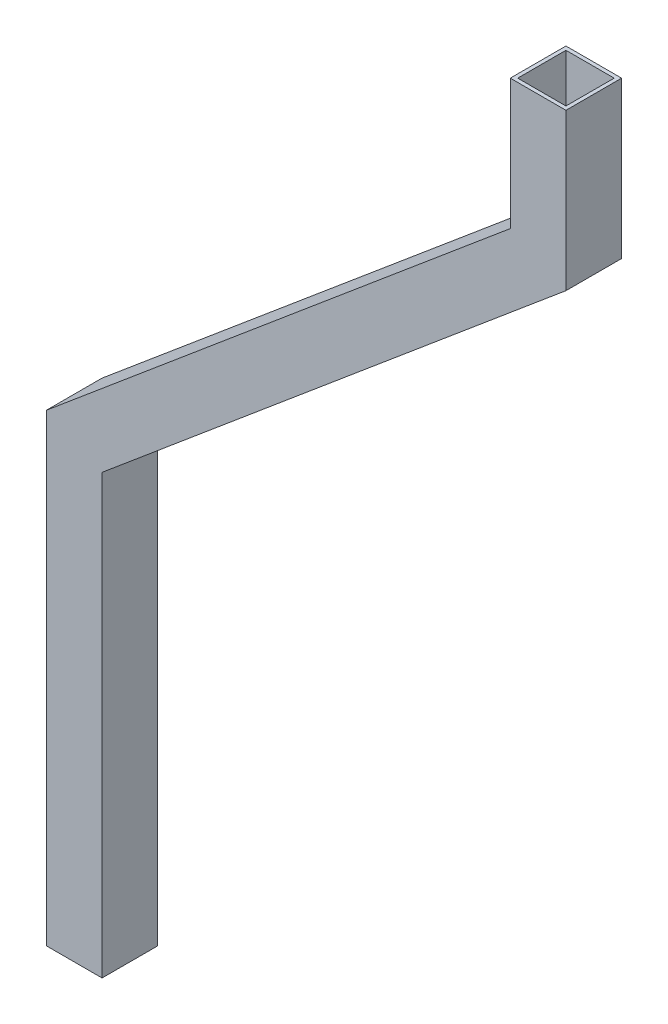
ISO-10303-21;
HEADER;
FILE_DESCRIPTION(('STEP AP214'),'2;1');
FILE_NAME('part.step','',(''),(''),'','','');
FILE_SCHEMA(('AUTOMOTIVE_DESIGN { 1 0 10303 214 1 1 1 1 }'));
ENDSEC;
DATA;
#1=APPLICATION_CONTEXT('core data for automotive mechanical design processes');
#2=APPLICATION_PROTOCOL_DEFINITION('international standard','automotive_design',2000,#1);
#3=PRODUCT_CONTEXT('',#1,'mechanical');
#4=PRODUCT('Part','Part','',(#3));
#5=PRODUCT_RELATED_PRODUCT_CATEGORY('part','',(#4));
#6=PRODUCT_DEFINITION_FORMATION('','',#4);
#7=PRODUCT_DEFINITION_CONTEXT('part definition',#1,'design');
#8=PRODUCT_DEFINITION('design','',#6,#7);
#9=PRODUCT_DEFINITION_SHAPE('','',#8);
#10=(LENGTH_UNIT() NAMED_UNIT(*) SI_UNIT(.MILLI.,.METRE.));
#11=(NAMED_UNIT(*) PLANE_ANGLE_UNIT() SI_UNIT($,.RADIAN.));
#12=(NAMED_UNIT(*) SI_UNIT($,.STERADIAN.) SOLID_ANGLE_UNIT());
#13=UNCERTAINTY_MEASURE_WITH_UNIT(LENGTH_MEASURE(1.E-05),#10,'distance_accuracy_value','');
#14=(GEOMETRIC_REPRESENTATION_CONTEXT(3) GLOBAL_UNCERTAINTY_ASSIGNED_CONTEXT((#13)) GLOBAL_UNIT_ASSIGNED_CONTEXT((#10,
#11,#12)) REPRESENTATION_CONTEXT('',''));
#15=CARTESIAN_POINT('',(0.,0.,0.));
#16=DIRECTION('',(0.,0.,1.));
#17=DIRECTION('',(1.,0.,0.));
#18=AXIS2_PLACEMENT_3D('',#15,#16,#17);
#19=CARTESIAN_POINT('',(250.,530.,0.));
#20=DIRECTION('',(0.,1.,0.));
#21=DIRECTION('',(0.,0.,1.));
#22=AXIS2_PLACEMENT_3D('',#19,#20,#21);
#23=PLANE('',#22);
#24=DIRECTION('',(0.,0.,1.));
#25=VECTOR('',#24,1.);
#26=CARTESIAN_POINT('',(252.,530.,0.));
#27=LINE('',#26,#25);
#28=CARTESIAN_POINT('',(252.,530.,2.));
#29=VERTEX_POINT('',#28);
#30=CARTESIAN_POINT('',(252.,530.,28.));
#31=VERTEX_POINT('',#30);
#32=EDGE_CURVE('E168',#29,#31,#27,.T.);
#33=ORIENTED_EDGE('',*,*,#32,.F.);
#34=DIRECTION('',(-1.,0.,0.));
#35=VECTOR('',#34,1.);
#36=CARTESIAN_POINT('',(250.,530.,2.));
#37=LINE('',#36,#35);
#38=CARTESIAN_POINT('',(278.,530.,2.));
#39=VERTEX_POINT('',#38);
#40=EDGE_CURVE('E201',#39,#29,#37,.T.);
#41=ORIENTED_EDGE('',*,*,#40,.F.);
#42=DIRECTION('',(0.,0.,-1.));
#43=VECTOR('',#42,1.);
#44=CARTESIAN_POINT('',(278.,530.,0.));
#45=LINE('',#44,#43);
#46=CARTESIAN_POINT('',(278.,530.,28.));
#47=VERTEX_POINT('',#46);
#48=EDGE_CURVE('E199',#47,#39,#45,.T.);
#49=ORIENTED_EDGE('',*,*,#48,.F.);
#50=DIRECTION('',(1.,0.,0.));
#51=VECTOR('',#50,1.);
#52=CARTESIAN_POINT('',(250.,530.,28.));
#53=LINE('',#52,#51);
#54=EDGE_CURVE('E197',#31,#47,#53,.T.);
#55=ORIENTED_EDGE('',*,*,#54,.F.);
#56=EDGE_LOOP('',(#33,#41,#49,#55));
#57=FACE_BOUND('',#56,.T.);
#58=DIRECTION('',(0.,0.,1.));
#59=VECTOR('',#58,1.);
#60=CARTESIAN_POINT('',(250.,530.,0.));
#61=LINE('',#60,#59);
#62=CARTESIAN_POINT('',(250.,530.,0.));
#63=VERTEX_POINT('',#62);
#64=CARTESIAN_POINT('',(250.,530.,30.));
#65=VERTEX_POINT('',#64);
#66=EDGE_CURVE('E263',#63,#65,#61,.T.);
#67=ORIENTED_EDGE('',*,*,#66,.T.);
#68=DIRECTION('',(1.,0.,0.));
#69=VECTOR('',#68,1.);
#70=CARTESIAN_POINT('',(250.,530.,30.));
#71=LINE('',#70,#69);
#72=CARTESIAN_POINT('',(280.,530.,30.));
#73=VERTEX_POINT('',#72);
#74=EDGE_CURVE('E261',#65,#73,#71,.T.);
#75=ORIENTED_EDGE('',*,*,#74,.T.);
#76=DIRECTION('',(0.,0.,-1.));
#77=VECTOR('',#76,1.);
#78=CARTESIAN_POINT('',(280.,530.,0.));
#79=LINE('',#78,#77);
#80=CARTESIAN_POINT('',(280.,530.,0.));
#81=VERTEX_POINT('',#80);
#82=EDGE_CURVE('E259',#73,#81,#79,.T.);
#83=ORIENTED_EDGE('',*,*,#82,.T.);
#84=DIRECTION('',(-1.,0.,0.));
#85=VECTOR('',#84,1.);
#86=CARTESIAN_POINT('',(250.,530.,0.));
#87=LINE('',#86,#85);
#88=EDGE_CURVE('E206',#81,#63,#87,.T.);
#89=ORIENTED_EDGE('',*,*,#88,.T.);
#90=EDGE_LOOP('',(#67,#75,#83,#89));
#91=FACE_BOUND('',#90,.T.);
#92=ADVANCED_FACE('F36',(#57,#91),#23,.T.);
#93=CARTESIAN_POINT('',(0.,0.,0.));
#94=DIRECTION('',(0.,1.,0.));
#95=DIRECTION('',(0.,0.,1.));
#96=AXIS2_PLACEMENT_3D('',#93,#94,#95);
#97=PLANE('',#96);
#98=DIRECTION('',(-1.,0.,0.));
#99=VECTOR('',#98,1.);
#100=CARTESIAN_POINT('',(0.,0.,2.));
#101=LINE('',#100,#99);
#102=CARTESIAN_POINT('',(28.,0.,2.));
#103=VERTEX_POINT('',#102);
#104=CARTESIAN_POINT('',(2.,0.,2.));
#105=VERTEX_POINT('',#104);
#106=EDGE_CURVE('E191',#103,#105,#101,.T.);
#107=ORIENTED_EDGE('',*,*,#106,.T.);
#108=DIRECTION('',(0.,0.,1.));
#109=VECTOR('',#108,1.);
#110=CARTESIAN_POINT('',(2.,0.,0.));
#111=LINE('',#110,#109);
#112=CARTESIAN_POINT('',(2.00000000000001,0.,28.));
#113=VERTEX_POINT('',#112);
#114=EDGE_CURVE('E203',#105,#113,#111,.T.);
#115=ORIENTED_EDGE('',*,*,#114,.T.);
#116=DIRECTION('',(1.,0.,0.));
#117=VECTOR('',#116,1.);
#118=CARTESIAN_POINT('',(0.,0.,28.));
#119=LINE('',#118,#117);
#120=CARTESIAN_POINT('',(28.,0.,28.));
#121=VERTEX_POINT('',#120);
#122=EDGE_CURVE('E207',#113,#121,#119,.T.);
#123=ORIENTED_EDGE('',*,*,#122,.T.);
#124=DIRECTION('',(0.,0.,-1.));
#125=VECTOR('',#124,1.);
#126=CARTESIAN_POINT('',(28.,0.,0.));
#127=LINE('',#126,#125);
#128=EDGE_CURVE('E210',#121,#103,#127,.T.);
#129=ORIENTED_EDGE('',*,*,#128,.T.);
#130=EDGE_LOOP('',(#107,#115,#123,#129));
#131=FACE_BOUND('',#130,.T.);
#132=DIRECTION('',(0.,0.,1.));
#133=VECTOR('',#132,1.);
#134=CARTESIAN_POINT('',(0.,0.,0.));
#135=LINE('',#134,#133);
#136=CARTESIAN_POINT('',(0.,0.,0.));
#137=VERTEX_POINT('',#136);
#138=CARTESIAN_POINT('',(0.,0.,30.));
#139=VERTEX_POINT('',#138);
#140=EDGE_CURVE('E11',#137,#139,#135,.T.);
#141=ORIENTED_EDGE('',*,*,#140,.F.);
#142=DIRECTION('',(-1.,0.,0.));
#143=VECTOR('',#142,1.);
#144=CARTESIAN_POINT('',(0.,0.,0.));
#145=LINE('',#144,#143);
#146=CARTESIAN_POINT('',(30.,0.,0.));
#147=VERTEX_POINT('',#146);
#148=EDGE_CURVE('E215',#147,#137,#145,.T.);
#149=ORIENTED_EDGE('',*,*,#148,.F.);
#150=DIRECTION('',(0.,0.,-1.));
#151=VECTOR('',#150,1.);
#152=CARTESIAN_POINT('',(30.,0.,0.));
#153=LINE('',#152,#151);
#154=CARTESIAN_POINT('',(30.,0.,30.));
#155=VERTEX_POINT('',#154);
#156=EDGE_CURVE('E218',#155,#147,#153,.T.);
#157=ORIENTED_EDGE('',*,*,#156,.F.);
#158=DIRECTION('',(1.,0.,0.));
#159=VECTOR('',#158,1.);
#160=CARTESIAN_POINT('',(0.,0.,30.));
#161=LINE('',#160,#159);
#162=EDGE_CURVE('E44',#139,#155,#161,.T.);
#163=ORIENTED_EDGE('',*,*,#162,.F.);
#164=EDGE_LOOP('',(#141,#149,#157,#163));
#165=FACE_BOUND('',#164,.T.);
#166=ADVANCED_FACE('F293',(#131,#165),#97,.F.);
#167=CARTESIAN_POINT('',(250.,444.286755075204,0.));
#168=DIRECTION('',(-1.,0.,0.));
#169=DIRECTION('',(0.,0.,1.));
#170=AXIS2_PLACEMENT_3D('',#167,#168,#169);
#171=PLANE('',#170);
#172=DIRECTION('',(0.,0.,-1.));
#173=VECTOR('',#172,1.);
#174=CARTESIAN_POINT('',(250.,459.774907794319,0.));
#175=LINE('',#174,#173);
#176=CARTESIAN_POINT('',(250.,459.774907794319,30.));
#177=VERTEX_POINT('',#176);
#178=CARTESIAN_POINT('',(250.,459.774907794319,0.));
#179=VERTEX_POINT('',#178);
#180=EDGE_CURVE('E243',#177,#179,#175,.T.);
#181=ORIENTED_EDGE('',*,*,#180,.F.);
#182=DIRECTION('',(0.,1.,0.));
#183=VECTOR('',#182,1.);
#184=CARTESIAN_POINT('',(250.,444.286755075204,30.));
#185=LINE('',#184,#183);
#186=EDGE_CURVE('E270',#177,#65,#185,.T.);
#187=ORIENTED_EDGE('',*,*,#186,.T.);
#188=ORIENTED_EDGE('',*,*,#66,.F.);
#189=DIRECTION('',(0.,1.,0.));
#190=VECTOR('',#189,1.);
#191=CARTESIAN_POINT('',(250.,444.286755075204,0.));
#192=LINE('',#191,#190);
#193=EDGE_CURVE('E39',#179,#63,#192,.T.);
#194=ORIENTED_EDGE('',*,*,#193,.F.);
#195=EDGE_LOOP('',(#181,#187,#188,#194));
#196=FACE_BOUND('',#195,.T.);
#197=ADVANCED_FACE('F280',(#196),#171,.T.);
#198=CARTESIAN_POINT('',(280.,444.286755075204,0.));
#199=DIRECTION('',(1.,0.,0.));
#200=DIRECTION('',(0.,0.,-1.));
#201=AXIS2_PLACEMENT_3D('',#198,#199,#200);
#202=PLANE('',#201);
#203=DIRECTION('',(0.,0.,1.));
#204=VECTOR('',#203,1.);
#205=CARTESIAN_POINT('',(280.,445.785678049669,0.));
#206=LINE('',#205,#204);
#207=CARTESIAN_POINT('',(280.,445.785678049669,0.));
#208=VERTEX_POINT('',#207);
#209=CARTESIAN_POINT('',(280.,445.785678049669,30.));
#210=VERTEX_POINT('',#209);
#211=EDGE_CURVE('E236',#208,#210,#206,.T.);
#212=ORIENTED_EDGE('',*,*,#211,.F.);
#213=DIRECTION('',(0.,1.,0.));
#214=VECTOR('',#213,1.);
#215=CARTESIAN_POINT('',(280.,444.286755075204,0.));
#216=LINE('',#215,#214);
#217=EDGE_CURVE('E265',#208,#81,#216,.T.);
#218=ORIENTED_EDGE('',*,*,#217,.T.);
#219=ORIENTED_EDGE('',*,*,#82,.F.);
#220=DIRECTION('',(0.,1.,0.));
#221=VECTOR('',#220,1.);
#222=CARTESIAN_POINT('',(280.,444.286755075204,30.));
#223=LINE('',#222,#221);
#224=EDGE_CURVE('E268',#210,#73,#223,.T.);
#225=ORIENTED_EDGE('',*,*,#224,.F.);
#226=EDGE_LOOP('',(#212,#218,#219,#225));
#227=FACE_BOUND('',#226,.T.);
#228=ADVANCED_FACE('F302',(#227),#202,.T.);
#229=CARTESIAN_POINT('',(19.2836282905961,227.018666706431,0.));
#230=DIRECTION('',(0.642787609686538,-0.766044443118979,0.));
#231=DIRECTION('',(0.766044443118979,0.642787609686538,0.));
#232=AXIS2_PLACEMENT_3D('',#229,#230,#231);
#233=PLANE('',#232);
#234=DIRECTION('',(0.766044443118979,0.642787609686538,0.));
#235=VECTOR('',#234,1.);
#236=CARTESIAN_POINT('',(19.2836282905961,227.018666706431,0.));
#237=LINE('',#236,#235);
#238=CARTESIAN_POINT('',(30.,236.01077025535,0.));
#239=VERTEX_POINT('',#238);
#240=EDGE_CURVE('E251',#239,#208,#237,.T.);
#241=ORIENTED_EDGE('',*,*,#240,.T.);
#242=ORIENTED_EDGE('',*,*,#211,.T.);
#243=DIRECTION('',(0.766044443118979,0.642787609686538,0.));
#244=VECTOR('',#243,1.);
#245=CARTESIAN_POINT('',(19.2836282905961,227.018666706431,30.));
#246=LINE('',#245,#244);
#247=CARTESIAN_POINT('',(30.,236.01077025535,30.));
#248=VERTEX_POINT('',#247);
#249=EDGE_CURVE('E250',#248,#210,#246,.T.);
#250=ORIENTED_EDGE('',*,*,#249,.F.);
#251=DIRECTION('',(0.,0.,1.));
#252=VECTOR('',#251,1.);
#253=CARTESIAN_POINT('',(30.,236.01077025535,0.));
#254=LINE('',#253,#252);
#255=EDGE_CURVE('E232',#239,#248,#254,.T.);
#256=ORIENTED_EDGE('',*,*,#255,.F.);
#257=EDGE_LOOP('',(#241,#242,#250,#256));
#258=FACE_BOUND('',#257,.T.);
#259=ADVANCED_FACE('F300',(#258),#233,.T.);
#260=CARTESIAN_POINT('',(0.,250.,0.));
#261=DIRECTION('',(-0.642787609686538,0.766044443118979,0.));
#262=DIRECTION('',(-0.766044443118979,-0.642787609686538,0.));
#263=AXIS2_PLACEMENT_3D('',#260,#261,#262);
#264=PLANE('',#263);
#265=DIRECTION('',(0.766044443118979,0.642787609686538,0.));
#266=VECTOR('',#265,1.);
#267=CARTESIAN_POINT('',(0.,250.,30.));
#268=LINE('',#267,#266);
#269=CARTESIAN_POINT('',(0.,250.,30.));
#270=VERTEX_POINT('',#269);
#271=EDGE_CURVE('E247',#270,#177,#268,.T.);
#272=ORIENTED_EDGE('',*,*,#271,.T.);
#273=ORIENTED_EDGE('',*,*,#180,.T.);
#274=DIRECTION('',(0.766044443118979,0.642787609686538,0.));
#275=VECTOR('',#274,1.);
#276=CARTESIAN_POINT('',(0.,250.,0.));
#277=LINE('',#276,#275);
#278=CARTESIAN_POINT('',(0.,250.,0.));
#279=VERTEX_POINT('',#278);
#280=EDGE_CURVE('E244',#279,#179,#277,.T.);
#281=ORIENTED_EDGE('',*,*,#280,.F.);
#282=DIRECTION('',(0.,0.,1.));
#283=VECTOR('',#282,1.);
#284=CARTESIAN_POINT('',(0.,250.,0.));
#285=LINE('',#284,#283);
#286=EDGE_CURVE('E226',#279,#270,#285,.T.);
#287=ORIENTED_EDGE('',*,*,#286,.T.);
#288=EDGE_LOOP('',(#272,#273,#281,#287));
#289=FACE_BOUND('',#288,.T.);
#290=ADVANCED_FACE('F282',(#289),#264,.T.);
#291=CARTESIAN_POINT('',(0.,0.,0.));
#292=DIRECTION('',(-1.,0.,0.));
#293=DIRECTION('',(0.,0.,1.));
#294=AXIS2_PLACEMENT_3D('',#291,#292,#293);
#295=PLANE('',#294);
#296=DIRECTION('',(0.,1.,0.));
#297=VECTOR('',#296,1.);
#298=CARTESIAN_POINT('',(0.,0.,30.));
#299=LINE('',#298,#297);
#300=EDGE_CURVE('E227',#139,#270,#299,.T.);
#301=ORIENTED_EDGE('',*,*,#300,.T.);
#302=ORIENTED_EDGE('',*,*,#286,.F.);
#303=DIRECTION('',(0.,1.,0.));
#304=VECTOR('',#303,1.);
#305=CARTESIAN_POINT('',(0.,0.,0.));
#306=LINE('',#305,#304);
#307=EDGE_CURVE('E219',#137,#279,#306,.T.);
#308=ORIENTED_EDGE('',*,*,#307,.F.);
#309=ORIENTED_EDGE('',*,*,#140,.T.);
#310=EDGE_LOOP('',(#301,#302,#308,#309));
#311=FACE_BOUND('',#310,.T.);
#312=ADVANCED_FACE('F290',(#311),#295,.T.);
#313=CARTESIAN_POINT('',(0.,0.,30.));
#314=DIRECTION('',(0.,0.,1.));
#315=DIRECTION('',(1.,0.,0.));
#316=AXIS2_PLACEMENT_3D('',#313,#314,#315);
#317=PLANE('',#316);
#318=DIRECTION('',(0.,1.,0.));
#319=VECTOR('',#318,1.);
#320=CARTESIAN_POINT('',(30.,0.,30.));
#321=LINE('',#320,#319);
#322=EDGE_CURVE('E230',#155,#248,#321,.T.);
#323=ORIENTED_EDGE('',*,*,#322,.T.);
#324=ORIENTED_EDGE('',*,*,#249,.T.);
#325=ORIENTED_EDGE('',*,*,#224,.T.);
#326=ORIENTED_EDGE('',*,*,#74,.F.);
#327=ORIENTED_EDGE('',*,*,#186,.F.);
#328=ORIENTED_EDGE('',*,*,#271,.F.);
#329=ORIENTED_EDGE('',*,*,#300,.F.);
#330=ORIENTED_EDGE('',*,*,#162,.T.);
#331=EDGE_LOOP('',(#323,#324,#325,#326,#327,#328,#329,#330));
#332=FACE_BOUND('',#331,.T.);
#333=ADVANCED_FACE('F287',(#332),#317,.T.);
#334=CARTESIAN_POINT('',(30.,0.,0.));
#335=DIRECTION('',(1.,0.,0.));
#336=DIRECTION('',(0.,0.,-1.));
#337=AXIS2_PLACEMENT_3D('',#334,#335,#336);
#338=PLANE('',#337);
#339=DIRECTION('',(0.,1.,0.));
#340=VECTOR('',#339,1.);
#341=CARTESIAN_POINT('',(30.,0.,0.));
#342=LINE('',#341,#340);
#343=EDGE_CURVE('E235',#147,#239,#342,.T.);
#344=ORIENTED_EDGE('',*,*,#343,.T.);
#345=ORIENTED_EDGE('',*,*,#255,.T.);
#346=ORIENTED_EDGE('',*,*,#322,.F.);
#347=ORIENTED_EDGE('',*,*,#156,.T.);
#348=EDGE_LOOP('',(#344,#345,#346,#347));
#349=FACE_BOUND('',#348,.T.);
#350=ADVANCED_FACE('F297',(#349),#338,.T.);
#351=CARTESIAN_POINT('',(0.,0.,0.));
#352=DIRECTION('',(0.,0.,-1.));
#353=DIRECTION('',(-1.,0.,0.));
#354=AXIS2_PLACEMENT_3D('',#351,#352,#353);
#355=PLANE('',#354);
#356=ORIENTED_EDGE('',*,*,#307,.T.);
#357=ORIENTED_EDGE('',*,*,#280,.T.);
#358=ORIENTED_EDGE('',*,*,#193,.T.);
#359=ORIENTED_EDGE('',*,*,#88,.F.);
#360=ORIENTED_EDGE('',*,*,#217,.F.);
#361=ORIENTED_EDGE('',*,*,#240,.F.);
#362=ORIENTED_EDGE('',*,*,#343,.F.);
#363=ORIENTED_EDGE('',*,*,#148,.T.);
#364=EDGE_LOOP('',(#356,#357,#358,#359,#360,#361,#362,#363));
#365=FACE_BOUND('',#364,.T.);
#366=ADVANCED_FACE('F278',(#365),#355,.T.);
#367=CARTESIAN_POINT('',(252.,444.286755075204,0.));
#368=DIRECTION('',(-1.,0.,0.));
#369=DIRECTION('',(0.,0.,1.));
#370=AXIS2_PLACEMENT_3D('',#367,#368,#369);
#371=PLANE('',#370);
#372=DIRECTION('',(0.,0.,-1.));
#373=VECTOR('',#372,1.);
#374=CARTESIAN_POINT('',(252.,458.842292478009,0.));
#375=LINE('',#374,#373);
#376=CARTESIAN_POINT('',(252.,458.842292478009,28.));
#377=VERTEX_POINT('',#376);
#378=CARTESIAN_POINT('',(252.,458.842292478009,2.));
#379=VERTEX_POINT('',#378);
#380=EDGE_CURVE('E152',#377,#379,#375,.T.);
#381=ORIENTED_EDGE('',*,*,#380,.T.);
#382=DIRECTION('',(0.,1.,0.));
#383=VECTOR('',#382,1.);
#384=CARTESIAN_POINT('',(252.,444.286755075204,2.));
#385=LINE('',#384,#383);
#386=EDGE_CURVE('E170',#379,#29,#385,.T.);
#387=ORIENTED_EDGE('',*,*,#386,.T.);
#388=ORIENTED_EDGE('',*,*,#32,.T.);
#389=DIRECTION('',(0.,1.,0.));
#390=VECTOR('',#389,1.);
#391=CARTESIAN_POINT('',(252.,444.286755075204,28.));
#392=LINE('',#391,#390);
#393=EDGE_CURVE('E165',#377,#31,#392,.T.);
#394=ORIENTED_EDGE('',*,*,#393,.F.);
#395=EDGE_LOOP('',(#381,#387,#388,#394));
#396=FACE_BOUND('',#395,.T.);
#397=ADVANCED_FACE('F166',(#396),#371,.F.);
#398=CARTESIAN_POINT('',(250.,444.286755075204,28.));
#399=DIRECTION('',(0.,0.,1.));
#400=DIRECTION('',(1.,0.,0.));
#401=AXIS2_PLACEMENT_3D('',#398,#399,#400);
#402=PLANE('',#401);
#403=DIRECTION('',(0.,1.,0.));
#404=VECTOR('',#403,1.);
#405=CARTESIAN_POINT('',(278.,444.286755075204,28.));
#406=LINE('',#405,#404);
#407=CARTESIAN_POINT('',(278.,446.718293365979,28.));
#408=VERTEX_POINT('',#407);
#409=EDGE_CURVE('E171',#408,#47,#406,.T.);
#410=ORIENTED_EDGE('',*,*,#409,.F.);
#411=DIRECTION('',(0.766044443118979,0.642787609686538,0.));
#412=VECTOR('',#411,1.);
#413=CARTESIAN_POINT('',(17.9980530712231,228.550755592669,28.));
#414=LINE('',#413,#412);
#415=CARTESIAN_POINT('',(28.,236.94338557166,28.));
#416=VERTEX_POINT('',#415);
#417=EDGE_CURVE('E176',#416,#408,#414,.T.);
#418=ORIENTED_EDGE('',*,*,#417,.F.);
#419=DIRECTION('',(0.,1.,0.));
#420=VECTOR('',#419,1.);
#421=CARTESIAN_POINT('',(28.,0.,28.));
#422=LINE('',#421,#420);
#423=EDGE_CURVE('E60',#121,#416,#422,.T.);
#424=ORIENTED_EDGE('',*,*,#423,.F.);
#425=ORIENTED_EDGE('',*,*,#122,.F.);
#426=DIRECTION('',(0.,1.,0.));
#427=VECTOR('',#426,1.);
#428=CARTESIAN_POINT('',(2.00000000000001,0.,28.));
#429=LINE('',#428,#427);
#430=CARTESIAN_POINT('',(2.00000000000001,249.06738468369,28.));
#431=VERTEX_POINT('',#430);
#432=EDGE_CURVE('E175',#113,#431,#429,.T.);
#433=ORIENTED_EDGE('',*,*,#432,.T.);
#434=DIRECTION('',(0.766044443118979,0.642787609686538,0.));
#435=VECTOR('',#434,1.);
#436=CARTESIAN_POINT('',(1.28557521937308,248.467911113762,28.));
#437=LINE('',#436,#435);
#438=EDGE_CURVE('E157',#431,#377,#437,.T.);
#439=ORIENTED_EDGE('',*,*,#438,.T.);
#440=ORIENTED_EDGE('',*,*,#393,.T.);
#441=ORIENTED_EDGE('',*,*,#54,.T.);
#442=EDGE_LOOP('',(#410,#418,#424,#425,#433,#439,#440,#441));
#443=FACE_BOUND('',#442,.T.);
#444=ADVANCED_FACE('F173',(#443),#402,.F.);
#445=CARTESIAN_POINT('',(278.,444.286755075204,0.));
#446=DIRECTION('',(1.,0.,0.));
#447=DIRECTION('',(0.,0.,-1.));
#448=AXIS2_PLACEMENT_3D('',#445,#446,#447);
#449=PLANE('',#448);
#450=DIRECTION('',(0.,0.,1.));
#451=VECTOR('',#450,1.);
#452=CARTESIAN_POINT('',(278.,446.718293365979,0.));
#453=LINE('',#452,#451);
#454=CARTESIAN_POINT('',(278.,446.718293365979,2.));
#455=VERTEX_POINT('',#454);
#456=EDGE_CURVE('E162',#455,#408,#453,.T.);
#457=ORIENTED_EDGE('',*,*,#456,.T.);
#458=ORIENTED_EDGE('',*,*,#409,.T.);
#459=ORIENTED_EDGE('',*,*,#48,.T.);
#460=DIRECTION('',(0.,1.,0.));
#461=VECTOR('',#460,1.);
#462=CARTESIAN_POINT('',(278.,444.286755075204,2.));
#463=LINE('',#462,#461);
#464=EDGE_CURVE('E52',#455,#39,#463,.T.);
#465=ORIENTED_EDGE('',*,*,#464,.F.);
#466=EDGE_LOOP('',(#457,#458,#459,#465));
#467=FACE_BOUND('',#466,.T.);
#468=ADVANCED_FACE('F382',(#467),#449,.F.);
#469=CARTESIAN_POINT('',(250.,444.286755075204,2.));
#470=DIRECTION('',(0.,0.,-1.));
#471=DIRECTION('',(-1.,0.,0.));
#472=AXIS2_PLACEMENT_3D('',#469,#470,#471);
#473=PLANE('',#472);
#474=ORIENTED_EDGE('',*,*,#386,.F.);
#475=DIRECTION('',(0.766044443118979,0.642787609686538,0.));
#476=VECTOR('',#475,1.);
#477=CARTESIAN_POINT('',(1.28557521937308,248.467911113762,2.));
#478=LINE('',#477,#476);
#479=CARTESIAN_POINT('',(1.99999999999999,249.06738468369,2.));
#480=VERTEX_POINT('',#479);
#481=EDGE_CURVE('E159',#480,#379,#478,.T.);
#482=ORIENTED_EDGE('',*,*,#481,.F.);
#483=DIRECTION('',(0.,1.,0.));
#484=VECTOR('',#483,1.);
#485=CARTESIAN_POINT('',(2.,0.,2.));
#486=LINE('',#485,#484);
#487=EDGE_CURVE('E187',#105,#480,#486,.T.);
#488=ORIENTED_EDGE('',*,*,#487,.F.);
#489=ORIENTED_EDGE('',*,*,#106,.F.);
#490=DIRECTION('',(0.,1.,0.));
#491=VECTOR('',#490,1.);
#492=CARTESIAN_POINT('',(28.,0.,2.));
#493=LINE('',#492,#491);
#494=CARTESIAN_POINT('',(28.,236.94338557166,2.));
#495=VERTEX_POINT('',#494);
#496=EDGE_CURVE('E193',#103,#495,#493,.T.);
#497=ORIENTED_EDGE('',*,*,#496,.T.);
#498=DIRECTION('',(0.766044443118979,0.642787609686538,0.));
#499=VECTOR('',#498,1.);
#500=CARTESIAN_POINT('',(17.9980530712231,228.550755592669,2.));
#501=LINE('',#500,#499);
#502=EDGE_CURVE('E180',#495,#455,#501,.T.);
#503=ORIENTED_EDGE('',*,*,#502,.T.);
#504=ORIENTED_EDGE('',*,*,#464,.T.);
#505=ORIENTED_EDGE('',*,*,#40,.T.);
#506=EDGE_LOOP('',(#474,#482,#488,#489,#497,#503,#504,#505));
#507=FACE_BOUND('',#506,.T.);
#508=ADVANCED_FACE('F392',(#507),#473,.F.);
#509=CARTESIAN_POINT('',(17.9980530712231,228.550755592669,0.));
#510=DIRECTION('',(0.642787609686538,-0.766044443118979,0.));
#511=DIRECTION('',(0.766044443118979,0.642787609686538,0.));
#512=AXIS2_PLACEMENT_3D('',#509,#510,#511);
#513=PLANE('',#512);
#514=ORIENTED_EDGE('',*,*,#502,.F.);
#515=DIRECTION('',(0.,0.,1.));
#516=VECTOR('',#515,1.);
#517=CARTESIAN_POINT('',(28.,236.94338557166,0.));
#518=LINE('',#517,#516);
#519=EDGE_CURVE('E184',#495,#416,#518,.T.);
#520=ORIENTED_EDGE('',*,*,#519,.T.);
#521=ORIENTED_EDGE('',*,*,#417,.T.);
#522=ORIENTED_EDGE('',*,*,#456,.F.);
#523=EDGE_LOOP('',(#514,#520,#521,#522));
#524=FACE_BOUND('',#523,.T.);
#525=ADVANCED_FACE('F403',(#524),#513,.F.);
#526=CARTESIAN_POINT('',(1.28557521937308,248.467911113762,0.));
#527=DIRECTION('',(-0.642787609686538,0.766044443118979,0.));
#528=DIRECTION('',(-0.766044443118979,-0.642787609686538,0.));
#529=AXIS2_PLACEMENT_3D('',#526,#527,#528);
#530=PLANE('',#529);
#531=ORIENTED_EDGE('',*,*,#438,.F.);
#532=DIRECTION('',(0.,0.,1.));
#533=VECTOR('',#532,1.);
#534=CARTESIAN_POINT('',(2.,249.06738468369,0.));
#535=LINE('',#534,#533);
#536=EDGE_CURVE('E185',#480,#431,#535,.T.);
#537=ORIENTED_EDGE('',*,*,#536,.F.);
#538=ORIENTED_EDGE('',*,*,#481,.T.);
#539=ORIENTED_EDGE('',*,*,#380,.F.);
#540=EDGE_LOOP('',(#531,#537,#538,#539));
#541=FACE_BOUND('',#540,.T.);
#542=ADVANCED_FACE('F154',(#541),#530,.F.);
#543=CARTESIAN_POINT('',(2.,0.,0.));
#544=DIRECTION('',(-1.,0.,0.));
#545=DIRECTION('',(0.,0.,1.));
#546=AXIS2_PLACEMENT_3D('',#543,#544,#545);
#547=PLANE('',#546);
#548=ORIENTED_EDGE('',*,*,#432,.F.);
#549=ORIENTED_EDGE('',*,*,#114,.F.);
#550=ORIENTED_EDGE('',*,*,#487,.T.);
#551=ORIENTED_EDGE('',*,*,#536,.T.);
#552=EDGE_LOOP('',(#548,#549,#550,#551));
#553=FACE_BOUND('',#552,.T.);
#554=ADVANCED_FACE('F313',(#553),#547,.F.);
#555=CARTESIAN_POINT('',(28.,0.,0.));
#556=DIRECTION('',(1.,0.,0.));
#557=DIRECTION('',(0.,0.,-1.));
#558=AXIS2_PLACEMENT_3D('',#555,#556,#557);
#559=PLANE('',#558);
#560=ORIENTED_EDGE('',*,*,#496,.F.);
#561=ORIENTED_EDGE('',*,*,#128,.F.);
#562=ORIENTED_EDGE('',*,*,#423,.T.);
#563=ORIENTED_EDGE('',*,*,#519,.F.);
#564=EDGE_LOOP('',(#560,#561,#562,#563));
#565=FACE_BOUND('',#564,.T.);
#566=ADVANCED_FACE('F307',(#565),#559,.F.);
#567=CLOSED_SHELL('',(#92,#166,#197,#228,#259,#290,#312,#333,#350,#366,#397,#444,#468,#508,#525,
#542,#554,#566));
#568=MANIFOLD_SOLID_BREP('B2',#567);
#569=ADVANCED_BREP_SHAPE_REPRESENTATION('',(#18,#568),#14);
#570=SHAPE_DEFINITION_REPRESENTATION(#9,#569);
ENDSEC;
END-ISO-10303-21;
